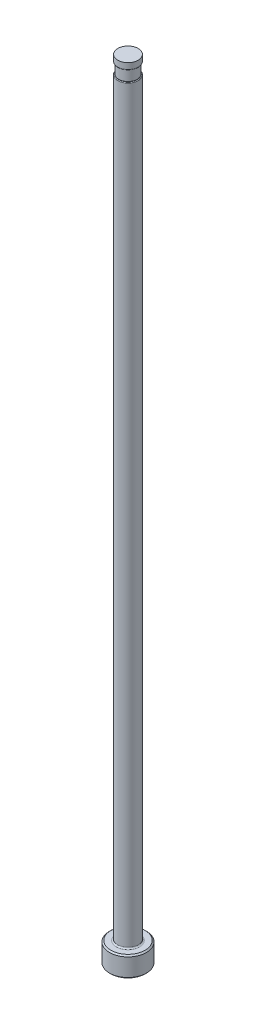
ISO-10303-21;
HEADER;
FILE_DESCRIPTION(('STEP AP214'),'2;1');
FILE_NAME('part.step','',(''),(''),'','','');
FILE_SCHEMA(('AUTOMOTIVE_DESIGN { 1 0 10303 214 1 1 1 1 }'));
ENDSEC;
DATA;
#1=APPLICATION_CONTEXT('core data for automotive mechanical design processes');
#2=APPLICATION_PROTOCOL_DEFINITION('international standard','automotive_design',2000,#1);
#3=PRODUCT_CONTEXT('',#1,'mechanical');
#4=PRODUCT('Part','Part','',(#3));
#5=PRODUCT_RELATED_PRODUCT_CATEGORY('part','',(#4));
#6=PRODUCT_DEFINITION_FORMATION('','',#4);
#7=PRODUCT_DEFINITION_CONTEXT('part definition',#1,'design');
#8=PRODUCT_DEFINITION('design','',#6,#7);
#9=PRODUCT_DEFINITION_SHAPE('','',#8);
#10=(LENGTH_UNIT() NAMED_UNIT(*) SI_UNIT(.MILLI.,.METRE.));
#11=(NAMED_UNIT(*) PLANE_ANGLE_UNIT() SI_UNIT($,.RADIAN.));
#12=(NAMED_UNIT(*) SI_UNIT($,.STERADIAN.) SOLID_ANGLE_UNIT());
#13=UNCERTAINTY_MEASURE_WITH_UNIT(LENGTH_MEASURE(1.E-05),#10,'distance_accuracy_value','');
#14=(GEOMETRIC_REPRESENTATION_CONTEXT(3) GLOBAL_UNCERTAINTY_ASSIGNED_CONTEXT((#13)) GLOBAL_UNIT_ASSIGNED_CONTEXT((#10,
#11,#12)) REPRESENTATION_CONTEXT('',''));
#15=CARTESIAN_POINT('',(0.,0.,0.));
#16=DIRECTION('',(0.,0.,1.));
#17=DIRECTION('',(1.,0.,0.));
#18=AXIS2_PLACEMENT_3D('',#15,#16,#17);
#19=CARTESIAN_POINT('',(-1.98373999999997,151.13,0.));
#20=DIRECTION('',(0.,1.,0.));
#21=DIRECTION('',(0.,0.,1.));
#22=AXIS2_PLACEMENT_3D('',#19,#20,#21);
#23=PLANE('',#22);
#24=CARTESIAN_POINT('',(0.,151.13,0.));
#25=DIRECTION('',(0.,1.,0.));
#26=DIRECTION('',(0.,0.,1.));
#27=AXIS2_PLACEMENT_3D('',#24,#25,#26);
#28=CIRCLE('',#27,1.84403999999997);
#29=CARTESIAN_POINT('',(0.,151.13,1.84403999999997));
#30=VERTEX_POINT('',#29);
#31=EDGE_CURVE('E11',#30,#30,#28,.F.);
#32=ORIENTED_EDGE('',*,*,#31,.T.);
#33=EDGE_LOOP('',(#32));
#34=FACE_BOUND('',#33,.T.);
#35=CARTESIAN_POINT('',(0.,151.13,0.));
#36=DIRECTION('',(0.,1.,0.));
#37=DIRECTION('',(0.,0.,1.));
#38=AXIS2_PLACEMENT_3D('',#35,#36,#37);
#39=CIRCLE('',#38,1.78053999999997);
#40=CARTESIAN_POINT('',(0.,151.13,1.78053999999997));
#41=VERTEX_POINT('',#40);
#42=EDGE_CURVE('E78',#41,#41,#39,.T.);
#43=ORIENTED_EDGE('',*,*,#42,.T.);
#44=EDGE_LOOP('',(#43));
#45=FACE_BOUND('',#44,.T.);
#46=ADVANCED_FACE('F36',(#34,#45),#23,.F.);
#47=CARTESIAN_POINT('',(0.,259.958771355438,0.));
#48=DIRECTION('',(0.,1.,0.));
#49=DIRECTION('',(0.,0.,1.));
#50=AXIS2_PLACEMENT_3D('',#47,#48,#49);
#51=CYLINDRICAL_SURFACE('',#50,1.98373999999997);
#52=DIRECTION('',(0.,1.,0.));
#53=VECTOR('',#52,1.);
#54=CARTESIAN_POINT('',(-1.78053999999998,259.958771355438,-0.87458658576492));
#55=LINE('',#54,#53);
#56=CARTESIAN_POINT('',(-1.78053999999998,148.971,-0.87458658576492));
#57=VERTEX_POINT('',#56);
#58=CARTESIAN_POINT('',(-1.78053999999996,86.614,-0.874586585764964));
#59=VERTEX_POINT('',#58);
#60=EDGE_CURVE('E73',#57,#59,#55,.F.);
#61=ORIENTED_EDGE('',*,*,#60,.F.);
#62=CARTESIAN_POINT('',(0.,148.971,0.));
#63=DIRECTION('',(0.,-1.,0.));
#64=DIRECTION('',(0.,0.,-1.));
#65=AXIS2_PLACEMENT_3D('',#62,#63,#64);
#66=CIRCLE('',#65,1.98373999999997);
#67=CARTESIAN_POINT('',(-1.78053999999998,148.971,0.87458658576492));
#68=VERTEX_POINT('',#67);
#69=EDGE_CURVE('E51',#57,#68,#66,.T.);
#70=ORIENTED_EDGE('',*,*,#69,.T.);
#71=DIRECTION('',(0.,1.,0.));
#72=VECTOR('',#71,1.);
#73=CARTESIAN_POINT('',(-1.78053999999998,259.958771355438,0.87458658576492));
#74=LINE('',#73,#72);
#75=CARTESIAN_POINT('',(-1.78053999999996,86.614,0.874586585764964));
#76=VERTEX_POINT('',#75);
#77=EDGE_CURVE('E84',#76,#68,#74,.T.);
#78=ORIENTED_EDGE('',*,*,#77,.F.);
#79=CARTESIAN_POINT('',(-1.78053999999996,86.614,-0.874586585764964));
#80=CARTESIAN_POINT('',(-1.78053865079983,86.5812968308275,-0.874582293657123));
#81=CARTESIAN_POINT('',(-1.78104579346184,86.5486048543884,-0.873557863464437));
#82=CARTESIAN_POINT('',(-1.78306050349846,86.4833726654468,-0.869440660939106));
#83=CARTESIAN_POINT('',(-1.78456837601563,86.4508325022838,-0.866347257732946));
#84=CARTESIAN_POINT('',(-1.79058935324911,86.3533142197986,-0.853877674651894));
#85=CARTESIAN_POINT('',(-1.7965995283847,86.288794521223,-0.841311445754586));
#86=CARTESIAN_POINT('',(-1.81216655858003,86.162456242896,-0.807234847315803));
#87=CARTESIAN_POINT('',(-1.82173064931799,86.1006434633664,-0.785706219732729));
#88=CARTESIAN_POINT('',(-1.84353272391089,85.9818109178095,-0.733090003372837));
#89=CARTESIAN_POINT('',(-1.85576409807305,85.9247797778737,-0.702025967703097));
#90=CARTESIAN_POINT('',(-1.87864294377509,85.8296691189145,-0.637816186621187));
#91=CARTESIAN_POINT('',(-1.88904107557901,85.7901900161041,-0.606655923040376));
#92=CARTESIAN_POINT('',(-1.9096749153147,85.7169072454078,-0.538182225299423));
#93=CARTESIAN_POINT('',(-1.91991077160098,85.6830980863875,-0.500874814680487));
#94=CARTESIAN_POINT('',(-1.93765949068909,85.6272104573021,-0.426534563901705));
#95=CARTESIAN_POINT('',(-1.94535058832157,85.6041335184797,-0.390297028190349));
#96=CARTESIAN_POINT('',(-1.95906883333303,85.5641265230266,-0.314264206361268));
#97=CARTESIAN_POINT('',(-1.965096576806,85.5471942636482,-0.27447020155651));
#98=CARTESIAN_POINT('',(-1.97485334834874,85.5202257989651,-0.192104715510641));
#99=CARTESIAN_POINT('',(-1.97857112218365,85.5102233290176,-0.149520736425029));
#100=CARTESIAN_POINT('',(-1.98320696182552,85.497797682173,-0.0631103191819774));
#101=CARTESIAN_POINT('',(-1.98412600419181,85.4953718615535,-0.0192843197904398));
#102=CARTESIAN_POINT('',(-1.98310107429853,85.498100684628,0.0642372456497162));
#103=CARTESIAN_POINT('',(-1.98140057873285,85.5026106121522,0.103958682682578));
#104=CARTESIAN_POINT('',(-1.97575922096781,85.5178264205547,0.182020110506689));
#105=CARTESIAN_POINT('',(-1.97181856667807,85.5285317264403,0.220360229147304));
#106=CARTESIAN_POINT('',(-1.96206992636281,85.5557141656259,0.294827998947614));
#107=CARTESIAN_POINT('',(-1.95625507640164,85.5722125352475,0.330946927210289));
#108=CARTESIAN_POINT('',(-1.9432907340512,85.6103152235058,0.400107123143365));
#109=CARTESIAN_POINT('',(-1.93614084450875,85.6319210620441,0.433147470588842));
#110=CARTESIAN_POINT('',(-1.92029960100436,85.6819613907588,0.498934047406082));
#111=CARTESIAN_POINT('',(-1.91152531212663,85.7108706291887,0.531297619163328));
#112=CARTESIAN_POINT('',(-1.89377241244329,85.7730184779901,0.591469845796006));
#113=CARTESIAN_POINT('',(-1.88479370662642,85.8062591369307,0.619276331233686));
#114=CARTESIAN_POINT('',(-1.86569807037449,85.8823604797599,0.674838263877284));
#115=CARTESIAN_POINT('',(-1.85566100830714,85.9258824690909,0.701713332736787));
#116=CARTESIAN_POINT('',(-1.83693898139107,86.0164245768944,0.749356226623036));
#117=CARTESIAN_POINT('',(-1.82825528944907,86.0634479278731,0.770118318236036));
#118=CARTESIAN_POINT('',(-1.8111557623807,86.1701808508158,0.809629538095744));
#119=CARTESIAN_POINT('',(-1.8031876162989,86.2304653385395,0.827017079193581));
#120=CARTESIAN_POINT('',(-1.79067795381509,86.3530954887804,0.853764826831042));
#121=CARTESIAN_POINT('',(-1.78613494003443,86.4154402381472,0.863128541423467));
#122=CARTESIAN_POINT('',(-1.78247943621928,86.5007444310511,0.870628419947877));
#123=CARTESIAN_POINT('',(-1.78175210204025,86.5233874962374,0.872115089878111));
#124=CARTESIAN_POINT('',(-1.78078289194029,86.5686849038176,0.874092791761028));
#125=CARTESIAN_POINT('',(-1.78054010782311,86.5913391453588,0.874585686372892));
#126=CARTESIAN_POINT('',(-1.78053999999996,86.614,0.874586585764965));
#127=B_SPLINE_CURVE_WITH_KNOTS('',3,(#79,#80,#81,#82,#83,#84,#85,#86,#87,#88,#89,#90,#91,#92,
#93,#94,#95,#96,#97,#98,#99,#100,#101,#102,#103,#104,#105,#106,#107,#108,#109,#110,#111,#112,
#113,#114,#115,#116,#117,#118,#119,#120,#121,#122,#123,#124,#125,#126),.UNSPECIFIED.,.F.,.F.,(4,
2,2,2,2,2,2,2,2,2,2,2,2,2,2,2,2,2,2,2,2,2,2,4),(0.,0.098066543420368,0.196163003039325,
0.393415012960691,0.591070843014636,0.78824232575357,0.941736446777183,1.09508104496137,
1.22546509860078,1.35580236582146,1.48676976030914,1.6176914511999,1.73715752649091,
1.85661251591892,1.97651005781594,2.0964433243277,2.22876073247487,2.36114094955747,
2.51695507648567,2.67291488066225,2.86196277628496,3.05092797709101,3.11901829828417,
3.18698087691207),.UNSPECIFIED.);
#128=EDGE_CURVE('E81',#59,#76,#127,.T.);
#129=ORIENTED_EDGE('',*,*,#128,.F.);
#130=EDGE_LOOP('',(#61,#70,#78,#129));
#131=FACE_BOUND('',#130,.T.);
#132=CARTESIAN_POINT('',(0.,4.21640000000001,0.));
#133=DIRECTION('',(0.,1.,0.));
#134=DIRECTION('',(0.,0.,1.));
#135=AXIS2_PLACEMENT_3D('',#132,#133,#134);
#136=CIRCLE('',#135,1.98373999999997);
#137=CARTESIAN_POINT('',(0.,4.21640000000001,1.98373999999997));
#138=VERTEX_POINT('',#137);
#139=EDGE_CURVE('E116',#138,#138,#136,.T.);
#140=ORIENTED_EDGE('',*,*,#139,.T.);
#141=EDGE_LOOP('',(#140));
#142=FACE_BOUND('',#141,.T.);
#143=ADVANCED_FACE('F82',(#131,#142),#51,.T.);
#144=CARTESIAN_POINT('',(0.,0.,0.));
#145=DIRECTION('',(0.,-1.,0.));
#146=DIRECTION('',(0.,0.,-1.));
#147=AXIS2_PLACEMENT_3D('',#144,#145,#146);
#148=PLANE('',#147);
#149=CARTESIAN_POINT('',(0.,0.,0.));
#150=DIRECTION('',(0.,-1.,0.));
#151=DIRECTION('',(0.,0.,-1.));
#152=AXIS2_PLACEMENT_3D('',#149,#150,#151);
#153=CIRCLE('',#152,3.31469999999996);
#154=CARTESIAN_POINT('',(0.,0.,-3.31469999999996));
#155=VERTEX_POINT('',#154);
#156=EDGE_CURVE('E113',#155,#155,#153,.T.);
#157=ORIENTED_EDGE('',*,*,#156,.T.);
#158=EDGE_LOOP('',(#157));
#159=FACE_BOUND('',#158,.T.);
#160=ADVANCED_FACE('F192',(#159),#148,.T.);
#161=CARTESIAN_POINT('',(0.,259.958771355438,0.));
#162=DIRECTION('',(0.,1.,0.));
#163=DIRECTION('',(0.,0.,1.));
#164=AXIS2_PLACEMENT_3D('',#161,#162,#163);
#165=CYLINDRICAL_SURFACE('',#164,3.56869999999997);
#166=CARTESIAN_POINT('',(0.,3.70839999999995,0.));
#167=DIRECTION('',(0.,1.,0.));
#168=DIRECTION('',(0.,0.,1.));
#169=AXIS2_PLACEMENT_3D('',#166,#167,#168);
#170=CIRCLE('',#169,3.56869999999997);
#171=CARTESIAN_POINT('',(0.,3.70839999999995,3.56869999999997));
#172=VERTEX_POINT('',#171);
#173=EDGE_CURVE('E110',#172,#172,#170,.F.);
#174=ORIENTED_EDGE('',*,*,#173,.T.);
#175=EDGE_LOOP('',(#174));
#176=FACE_BOUND('',#175,.T.);
#177=CARTESIAN_POINT('',(0.,0.254000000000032,0.));
#178=DIRECTION('',(0.,-1.,0.));
#179=DIRECTION('',(0.,0.,-1.));
#180=AXIS2_PLACEMENT_3D('',#177,#178,#179);
#181=CIRCLE('',#180,3.56869999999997);
#182=CARTESIAN_POINT('',(0.,0.254000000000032,-3.56869999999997));
#183=VERTEX_POINT('',#182);
#184=EDGE_CURVE('E107',#183,#183,#181,.F.);
#185=ORIENTED_EDGE('',*,*,#184,.T.);
#186=EDGE_LOOP('',(#185));
#187=FACE_BOUND('',#186,.T.);
#188=ADVANCED_FACE('F195',(#176,#187),#165,.T.);
#189=CARTESIAN_POINT('',(-3.56869999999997,3.9624,0.));
#190=DIRECTION('',(0.,1.,0.));
#191=DIRECTION('',(0.,0.,1.));
#192=AXIS2_PLACEMENT_3D('',#189,#190,#191);
#193=PLANE('',#192);
#194=CARTESIAN_POINT('',(0.,3.9624,0.));
#195=DIRECTION('',(0.,1.,0.));
#196=DIRECTION('',(0.,0.,1.));
#197=AXIS2_PLACEMENT_3D('',#194,#195,#196);
#198=CIRCLE('',#197,2.23773999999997);
#199=CARTESIAN_POINT('',(0.,3.9624,2.23773999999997));
#200=VERTEX_POINT('',#199);
#201=EDGE_CURVE('E87',#200,#200,#198,.F.);
#202=ORIENTED_EDGE('',*,*,#201,.T.);
#203=EDGE_LOOP('',(#202));
#204=FACE_BOUND('',#203,.T.);
#205=CARTESIAN_POINT('',(0.,3.9624,0.));
#206=DIRECTION('',(0.,1.,0.));
#207=DIRECTION('',(0.,0.,1.));
#208=AXIS2_PLACEMENT_3D('',#205,#206,#207);
#209=CIRCLE('',#208,3.31469999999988);
#210=CARTESIAN_POINT('',(0.,3.9624,3.31469999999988));
#211=VERTEX_POINT('',#210);
#212=EDGE_CURVE('E104',#211,#211,#209,.T.);
#213=ORIENTED_EDGE('',*,*,#212,.T.);
#214=EDGE_LOOP('',(#213));
#215=FACE_BOUND('',#214,.T.);
#216=ADVANCED_FACE('F190',(#204,#215),#193,.T.);
#217=CARTESIAN_POINT('',(0.,3.96239999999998,0.));
#218=DIRECTION('',(0.,-1.,0.));
#219=DIRECTION('',(0.,0.,-1.));
#220=AXIS2_PLACEMENT_3D('',#217,#218,#219);
#221=CONICAL_SURFACE('',#220,3.31469999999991,0.785398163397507);
#222=ORIENTED_EDGE('',*,*,#173,.F.);
#223=EDGE_LOOP('',(#222));
#224=FACE_BOUND('',#223,.T.);
#225=ORIENTED_EDGE('',*,*,#212,.F.);
#226=EDGE_LOOP('',(#225));
#227=FACE_BOUND('',#226,.T.);
#228=ADVANCED_FACE('F186',(#224,#227),#221,.T.);
#229=CARTESIAN_POINT('',(0.,0.254000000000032,0.));
#230=DIRECTION('',(0.,1.,0.));
#231=DIRECTION('',(0.,0.,1.));
#232=AXIS2_PLACEMENT_3D('',#229,#230,#231);
#233=CONICAL_SURFACE('',#232,3.56869999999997,0.785398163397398);
#234=ORIENTED_EDGE('',*,*,#156,.F.);
#235=EDGE_LOOP('',(#234));
#236=FACE_BOUND('',#235,.T.);
#237=ORIENTED_EDGE('',*,*,#184,.F.);
#238=EDGE_LOOP('',(#237));
#239=FACE_BOUND('',#238,.T.);
#240=ADVANCED_FACE('F182',(#236,#239),#233,.T.);
#241=CARTESIAN_POINT('',(0.,4.21640000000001,0.));
#242=DIRECTION('',(0.,1.,0.));
#243=DIRECTION('',(0.,0.,1.));
#244=AXIS2_PLACEMENT_3D('',#241,#242,#243);
#245=TOROIDAL_SURFACE('',#244,2.23773999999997,0.254);
#246=ORIENTED_EDGE('',*,*,#201,.F.);
#247=EDGE_LOOP('',(#246));
#248=FACE_BOUND('',#247,.T.);
#249=ORIENTED_EDGE('',*,*,#139,.F.);
#250=EDGE_LOOP('',(#249));
#251=FACE_BOUND('',#250,.T.);
#252=ADVANCED_FACE('F147',(#248,#251),#245,.F.);
#253=CARTESIAN_POINT('',(-1.98373999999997,149.098,0.));
#254=DIRECTION('',(0.,-1.,0.));
#255=DIRECTION('',(0.,0.,-1.));
#256=AXIS2_PLACEMENT_3D('',#253,#254,#255);
#257=PLANE('',#256);
#258=DIRECTION('',(0.,0.,1.));
#259=VECTOR('',#258,1.);
#260=CARTESIAN_POINT('',(-1.78053999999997,149.098,0.));
#261=LINE('',#260,#259);
#262=CARTESIAN_POINT('',(-1.78053999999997,149.098,0.));
#263=VERTEX_POINT('',#262);
#264=CARTESIAN_POINT('',(-1.78053999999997,149.098,0.526460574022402));
#265=VERTEX_POINT('',#264);
#266=EDGE_CURVE('E90',#263,#265,#261,.T.);
#267=ORIENTED_EDGE('',*,*,#266,.T.);
#268=CARTESIAN_POINT('',(0.,149.098,0.));
#269=DIRECTION('',(0.,-1.,0.));
#270=DIRECTION('',(0.,0.,-1.));
#271=AXIS2_PLACEMENT_3D('',#268,#269,#270);
#272=CIRCLE('',#271,1.85673999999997);
#273=CARTESIAN_POINT('',(-1.78053999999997,149.098,-0.526460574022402));
#274=VERTEX_POINT('',#273);
#275=EDGE_CURVE('E86',#265,#274,#272,.F.);
#276=ORIENTED_EDGE('',*,*,#275,.T.);
#277=EDGE_CURVE('E79',#274,#263,#261,.T.);
#278=ORIENTED_EDGE('',*,*,#277,.T.);
#279=CARTESIAN_POINT('',(0.,149.098,0.));
#280=DIRECTION('',(0.,1.,0.));
#281=DIRECTION('',(0.,0.,1.));
#282=AXIS2_PLACEMENT_3D('',#279,#280,#281);
#283=CIRCLE('',#282,1.78053999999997);
#284=EDGE_CURVE('E101',#263,#263,#283,.T.);
#285=ORIENTED_EDGE('',*,*,#284,.F.);
#286=EDGE_LOOP('',(#267,#276,#278,#285));
#287=FACE_BOUND('',#286,.T.);
#288=ADVANCED_FACE('F144',(#287),#257,.F.);
#289=CARTESIAN_POINT('',(0.,153.448281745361,0.));
#290=DIRECTION('',(0.,1.,0.));
#291=DIRECTION('',(0.,0.,1.));
#292=AXIS2_PLACEMENT_3D('',#289,#290,#291);
#293=CYLINDRICAL_SURFACE('',#292,1.78053999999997);
#294=ORIENTED_EDGE('',*,*,#42,.F.);
#295=EDGE_LOOP('',(#294));
#296=FACE_BOUND('',#295,.T.);
#297=ORIENTED_EDGE('',*,*,#284,.T.);
#298=EDGE_LOOP('',(#297));
#299=FACE_BOUND('',#298,.T.);
#300=ADVANCED_FACE('F141',(#296,#299),#293,.T.);
#301=CARTESIAN_POINT('',(-1.78053999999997,150.114,-3.56869999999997));
#302=DIRECTION('',(1.,0.,0.));
#303=DIRECTION('',(0.,1.,0.));
#304=AXIS2_PLACEMENT_3D('',#301,#302,#303);
#305=PLANE('',#304);
#306=ORIENTED_EDGE('',*,*,#277,.F.);
#307=CARTESIAN_POINT('',(-1.78053999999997,149.098,-0.526460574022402));
#308=CARTESIAN_POINT('',(-1.78053999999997,149.097978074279,-0.547390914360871));
#309=CARTESIAN_POINT('',(-1.78053999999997,149.09758039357,-0.568347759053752));
#310=CARTESIAN_POINT('',(-1.78053999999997,149.095614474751,-0.61048753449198));
#311=CARTESIAN_POINT('',(-1.78053999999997,149.094030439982,-0.631669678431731));
#312=CARTESIAN_POINT('',(-1.78053999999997,149.089173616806,-0.674541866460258));
#313=CARTESIAN_POINT('',(-1.78053999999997,149.085847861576,-0.696226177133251));
#314=CARTESIAN_POINT('',(-1.78053999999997,149.076728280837,-0.739006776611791));
#315=CARTESIAN_POINT('',(-1.78053999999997,149.070950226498,-0.760105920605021));
#316=CARTESIAN_POINT('',(-1.78053999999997,149.060654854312,-0.787147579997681));
#317=CARTESIAN_POINT('',(-1.78053999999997,149.057896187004,-0.793754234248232));
#318=CARTESIAN_POINT('',(-1.78053999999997,149.051851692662,-0.806726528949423));
#319=CARTESIAN_POINT('',(-1.78053999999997,149.048565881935,-0.813092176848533));
#320=CARTESIAN_POINT('',(-1.78053999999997,149.041320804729,-0.825509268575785));
#321=CARTESIAN_POINT('',(-1.78053999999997,149.037355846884,-0.831557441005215));
#322=CARTESIAN_POINT('',(-1.78053999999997,149.02861692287,-0.843040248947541));
#323=CARTESIAN_POINT('',(-1.78053999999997,149.023845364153,-0.84847663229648));
#324=CARTESIAN_POINT('',(-1.78053999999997,149.015648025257,-0.856139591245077));
#325=CARTESIAN_POINT('',(-1.78053999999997,149.012558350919,-0.858723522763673));
#326=CARTESIAN_POINT('',(-1.78053999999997,149.006050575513,-0.863452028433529));
#327=CARTESIAN_POINT('',(-1.78053999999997,149.002632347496,-0.865596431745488));
#328=CARTESIAN_POINT('',(-1.78053999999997,148.995433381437,-0.869319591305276));
#329=CARTESIAN_POINT('',(-1.78053999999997,148.991648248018,-0.870890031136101));
#330=CARTESIAN_POINT('',(-1.78053999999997,148.983845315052,-0.873246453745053));
#331=CARTESIAN_POINT('',(-1.78053999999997,148.979828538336,-0.874035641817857));
#332=CARTESIAN_POINT('',(-1.78053999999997,148.974987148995,-0.874450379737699));
#333=CARTESIAN_POINT('',(-1.78053999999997,148.97419041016,-0.874501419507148));
#334=CARTESIAN_POINT('',(-1.78053999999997,148.972595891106,-0.874569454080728));
#335=CARTESIAN_POINT('',(-1.78053999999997,148.971798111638,-0.874586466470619));
#336=CARTESIAN_POINT('',(-1.78053999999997,148.971,-0.874586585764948));
#337=B_SPLINE_CURVE_WITH_KNOTS('',3,(#307,#308,#309,#310,#311,#312,#313,#314,#315,#316,#317,
#318,#319,#320,#321,#322,#323,#324,#325,#326,#327,#328,#329,#330,#331,#332,#333,#334,#335,#336),
.UNSPECIFIED.,.F.,.F.,(4,2,2,2,2,2,2,2,2,2,2,2,2,2,4),(0.,0.0628307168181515,0.126513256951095,
0.192255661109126,0.257581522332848,0.279042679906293,0.300503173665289,0.322153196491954,
0.343739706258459,0.355794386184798,0.367853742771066,0.380081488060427,0.392258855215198,
0.394653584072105,0.397047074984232),.UNSPECIFIED.);
#338=EDGE_CURVE('E59',#274,#57,#337,.T.);
#339=ORIENTED_EDGE('',*,*,#338,.T.);
#340=ORIENTED_EDGE('',*,*,#60,.T.);
#341=DIRECTION('',(0.,0.,1.));
#342=VECTOR('',#341,1.);
#343=CARTESIAN_POINT('',(-1.78053999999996,86.614,-3.56869999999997));
#344=LINE('',#343,#342);
#345=EDGE_CURVE('E77',#59,#76,#344,.T.);
#346=ORIENTED_EDGE('',*,*,#345,.T.);
#347=ORIENTED_EDGE('',*,*,#77,.T.);
#348=CARTESIAN_POINT('',(-1.78053999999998,148.971,0.87458658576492));
#349=CARTESIAN_POINT('',(-1.78053999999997,148.974428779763,0.874595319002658));
#350=CARTESIAN_POINT('',(-1.78053999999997,148.97784637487,0.87427209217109));
#351=CARTESIAN_POINT('',(-1.78053999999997,148.984538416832,0.873041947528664));
#352=CARTESIAN_POINT('',(-1.78053999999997,148.987814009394,0.872141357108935));
#353=CARTESIAN_POINT('',(-1.78053999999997,148.994906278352,0.869569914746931));
#354=CARTESIAN_POINT('',(-1.78053999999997,148.998675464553,0.867770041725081));
#355=CARTESIAN_POINT('',(-1.78053999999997,149.005882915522,0.863582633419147));
#356=CARTESIAN_POINT('',(-1.78053999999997,149.009319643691,0.861192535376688));
#357=CARTESIAN_POINT('',(-1.78053999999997,149.017682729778,0.854521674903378));
#358=CARTESIAN_POINT('',(-1.78053999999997,149.022361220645,0.849933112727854));
#359=CARTESIAN_POINT('',(-1.78053999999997,149.030984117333,0.840123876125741));
#360=CARTESIAN_POINT('',(-1.78053999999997,149.034927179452,0.834902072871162));
#361=CARTESIAN_POINT('',(-1.78053999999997,149.045616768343,0.819005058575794));
#362=CARTESIAN_POINT('',(-1.78053999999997,149.051546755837,0.807787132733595));
#363=CARTESIAN_POINT('',(-1.78053999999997,149.061885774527,0.784614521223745));
#364=CARTESIAN_POINT('',(-1.78053999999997,149.066281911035,0.77265454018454));
#365=CARTESIAN_POINT('',(-1.78053999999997,149.076197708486,0.741171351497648));
#366=CARTESIAN_POINT('',(-1.78053999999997,149.080834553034,0.721373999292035));
#367=CARTESIAN_POINT('',(-1.78053999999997,149.088183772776,0.681384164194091));
#368=CARTESIAN_POINT('',(-1.78053999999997,149.090888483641,0.661190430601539));
#369=CARTESIAN_POINT('',(-1.78053999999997,149.094786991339,0.621840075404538));
#370=CARTESIAN_POINT('',(-1.78053999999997,149.096058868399,0.602690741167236));
#371=CARTESIAN_POINT('',(-1.78053999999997,149.097654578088,0.56450905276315));
#372=CARTESIAN_POINT('',(-1.78053999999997,149.097986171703,0.545477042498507));
#373=CARTESIAN_POINT('',(-1.78053999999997,149.098,0.526460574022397));
#374=B_SPLINE_CURVE_WITH_KNOTS('',3,(#348,#349,#350,#351,#352,#353,#354,#355,#356,#357,#358,
#359,#360,#361,#362,#363,#364,#365,#366,#367,#368,#369,#370,#371,#372,#373),.UNSPECIFIED.,.F.,
.F.,(4,2,2,2,2,2,2,2,2,2,2,2,4),(0.,0.0102530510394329,0.0203956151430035,0.0328568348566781,
0.045373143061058,0.064921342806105,0.0845049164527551,0.122359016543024,0.160524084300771,
0.221350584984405,0.282417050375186,0.339964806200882,0.397036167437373),.UNSPECIFIED.);
#375=EDGE_CURVE('E172',#68,#265,#374,.T.);
#376=ORIENTED_EDGE('',*,*,#375,.T.);
#377=ORIENTED_EDGE('',*,*,#266,.F.);
#378=EDGE_LOOP('',(#306,#339,#340,#346,#347,#376,#377));
#379=FACE_BOUND('',#378,.T.);
#380=ADVANCED_FACE('F75',(#379),#305,.F.);
#381=CARTESIAN_POINT('',(-4.95553999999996,86.614,-3.56869999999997));
#382=DIRECTION('',(0.,0.,1.));
#383=DIRECTION('',(1.,0.,0.));
#384=AXIS2_PLACEMENT_3D('',#381,#382,#383);
#385=CYLINDRICAL_SURFACE('',#384,3.175);
#386=ORIENTED_EDGE('',*,*,#345,.F.);
#387=ORIENTED_EDGE('',*,*,#128,.T.);
#388=EDGE_LOOP('',(#386,#387));
#389=FACE_BOUND('',#388,.T.);
#390=ADVANCED_FACE('F89',(#389),#385,.F.);
#391=CARTESIAN_POINT('',(0.,152.687735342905,0.));
#392=DIRECTION('',(0.,1.,0.));
#393=DIRECTION('',(0.,0.,1.));
#394=AXIS2_PLACEMENT_3D('',#391,#392,#393);
#395=CYLINDRICAL_SURFACE('',#394,1.97103999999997);
#396=CARTESIAN_POINT('',(0.,151.257,0.));
#397=DIRECTION('',(0.,1.,0.));
#398=DIRECTION('',(0.,0.,1.));
#399=AXIS2_PLACEMENT_3D('',#396,#397,#398);
#400=CIRCLE('',#399,1.97103999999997);
#401=CARTESIAN_POINT('',(0.,151.257,1.97103999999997));
#402=VERTEX_POINT('',#401);
#403=EDGE_CURVE('E44',#402,#402,#400,.T.);
#404=ORIENTED_EDGE('',*,*,#403,.T.);
#405=EDGE_LOOP('',(#404));
#406=FACE_BOUND('',#405,.T.);
#407=CARTESIAN_POINT('',(0.,152.4,0.));
#408=DIRECTION('',(0.,1.,0.));
#409=DIRECTION('',(0.,0.,1.));
#410=AXIS2_PLACEMENT_3D('',#407,#408,#409);
#411=CIRCLE('',#410,1.97103999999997);
#412=CARTESIAN_POINT('',(0.,152.4,1.97103999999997));
#413=VERTEX_POINT('',#412);
#414=EDGE_CURVE('E91',#413,#413,#411,.T.);
#415=ORIENTED_EDGE('',*,*,#414,.F.);
#416=EDGE_LOOP('',(#415));
#417=FACE_BOUND('',#416,.T.);
#418=ADVANCED_FACE('F135',(#406,#417),#395,.T.);
#419=CARTESIAN_POINT('',(-1.98373999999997,152.4,0.));
#420=DIRECTION('',(0.,1.,0.));
#421=DIRECTION('',(0.,0.,1.));
#422=AXIS2_PLACEMENT_3D('',#419,#420,#421);
#423=PLANE('',#422);
#424=ORIENTED_EDGE('',*,*,#414,.T.);
#425=EDGE_LOOP('',(#424));
#426=FACE_BOUND('',#425,.T.);
#427=ADVANCED_FACE('F149',(#426),#423,.T.);
#428=CARTESIAN_POINT('',(0.,148.971,0.));
#429=DIRECTION('',(0.,-1.,0.));
#430=DIRECTION('',(0.,0.,-1.));
#431=AXIS2_PLACEMENT_3D('',#428,#429,#430);
#432=TOROIDAL_SURFACE('',#431,1.85673999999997,0.127);
#433=ORIENTED_EDGE('',*,*,#375,.F.);
#434=ORIENTED_EDGE('',*,*,#69,.F.);
#435=ORIENTED_EDGE('',*,*,#338,.F.);
#436=ORIENTED_EDGE('',*,*,#275,.F.);
#437=EDGE_LOOP('',(#433,#434,#435,#436));
#438=FACE_BOUND('',#437,.T.);
#439=ADVANCED_FACE('F151',(#438),#432,.T.);
#440=CARTESIAN_POINT('',(0.,151.257,0.));
#441=DIRECTION('',(0.,1.,0.));
#442=DIRECTION('',(0.,0.,1.));
#443=AXIS2_PLACEMENT_3D('',#440,#441,#442);
#444=TOROIDAL_SURFACE('',#443,1.84403999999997,0.127);
#445=ORIENTED_EDGE('',*,*,#31,.F.);
#446=EDGE_LOOP('',(#445));
#447=FACE_BOUND('',#446,.T.);
#448=ORIENTED_EDGE('',*,*,#403,.F.);
#449=EDGE_LOOP('',(#448));
#450=FACE_BOUND('',#449,.T.);
#451=ADVANCED_FACE('F38',(#447,#450),#444,.T.);
#452=CLOSED_SHELL('',(#46,#143,#160,#188,#216,#228,#240,#252,#288,#300,#380,#390,#418,#427,#439,#451));
#453=MANIFOLD_SOLID_BREP('B2',#452);
#454=ADVANCED_BREP_SHAPE_REPRESENTATION('',(#18,#453),#14);
#455=SHAPE_DEFINITION_REPRESENTATION(#9,#454);
ENDSEC;
END-ISO-10303-21;
